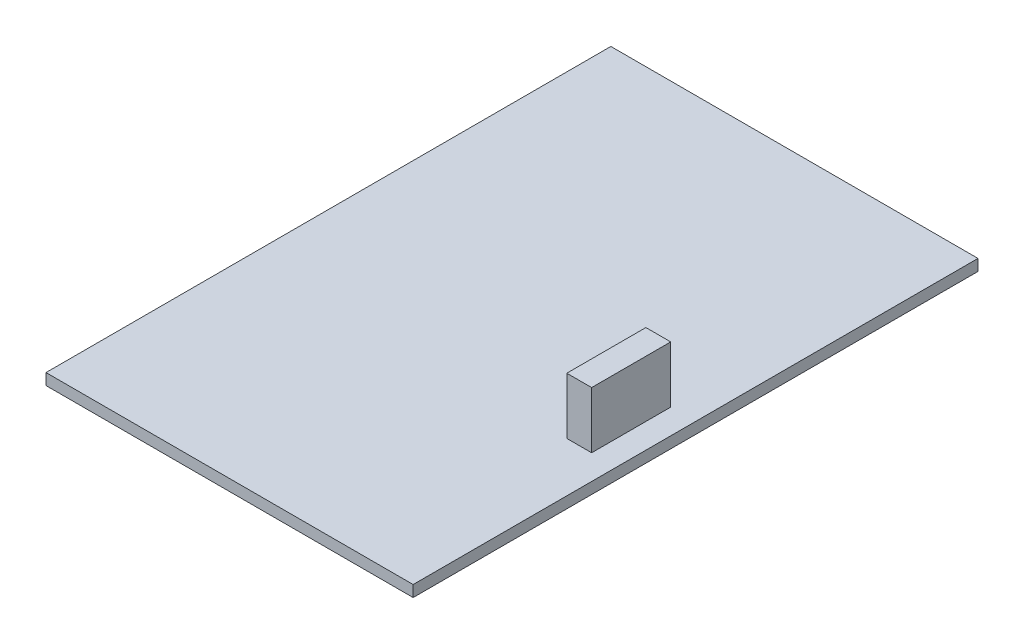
ISO-10303-21;
HEADER;
FILE_DESCRIPTION(('STEP AP214'),'2;1');
FILE_NAME('part.step','',(''),(''),'','','');
FILE_SCHEMA(('AUTOMOTIVE_DESIGN { 1 0 10303 214 1 1 1 1 }'));
ENDSEC;
DATA;
#1=APPLICATION_CONTEXT('core data for automotive mechanical design processes');
#2=APPLICATION_PROTOCOL_DEFINITION('international standard','automotive_design',2000,#1);
#3=PRODUCT_CONTEXT('',#1,'mechanical');
#4=PRODUCT('Part','Part','',(#3));
#5=PRODUCT_RELATED_PRODUCT_CATEGORY('part','',(#4));
#6=PRODUCT_DEFINITION_FORMATION('','',#4);
#7=PRODUCT_DEFINITION_CONTEXT('part definition',#1,'design');
#8=PRODUCT_DEFINITION('design','',#6,#7);
#9=PRODUCT_DEFINITION_SHAPE('','',#8);
#10=(LENGTH_UNIT() NAMED_UNIT(*) SI_UNIT(.MILLI.,.METRE.));
#11=(NAMED_UNIT(*) PLANE_ANGLE_UNIT() SI_UNIT($,.RADIAN.));
#12=(NAMED_UNIT(*) SI_UNIT($,.STERADIAN.) SOLID_ANGLE_UNIT());
#13=UNCERTAINTY_MEASURE_WITH_UNIT(LENGTH_MEASURE(1.E-05),#10,'distance_accuracy_value','');
#14=(GEOMETRIC_REPRESENTATION_CONTEXT(3) GLOBAL_UNCERTAINTY_ASSIGNED_CONTEXT((#13)) GLOBAL_UNIT_ASSIGNED_CONTEXT((#10,
#11,#12)) REPRESENTATION_CONTEXT('',''));
#15=CARTESIAN_POINT('',(0.,0.,0.));
#16=DIRECTION('',(0.,0.,1.));
#17=DIRECTION('',(1.,0.,0.));
#18=AXIS2_PLACEMENT_3D('',#15,#16,#17);
#19=CARTESIAN_POINT('',(0.,10.,0.));
#20=DIRECTION('',(0.,-1.,0.));
#21=DIRECTION('',(0.,0.,-1.));
#22=AXIS2_PLACEMENT_3D('',#19,#20,#21);
#23=PLANE('',#22);
#24=DIRECTION('',(0.,0.,1.));
#25=VECTOR('',#24,1.);
#26=CARTESIAN_POINT('',(0.,10.,0.));
#27=LINE('',#26,#25);
#28=CARTESIAN_POINT('',(0.,10.,-500.));
#29=VERTEX_POINT('',#28);
#30=CARTESIAN_POINT('',(0.,10.,0.));
#31=VERTEX_POINT('',#30);
#32=EDGE_CURVE('E130',#29,#31,#27,.T.);
#33=ORIENTED_EDGE('',*,*,#32,.T.);
#34=DIRECTION('',(1.,0.,0.));
#35=VECTOR('',#34,1.);
#36=CARTESIAN_POINT('',(0.,10.,0.));
#37=LINE('',#36,#35);
#38=CARTESIAN_POINT('',(325.,10.,0.));
#39=VERTEX_POINT('',#38);
#40=EDGE_CURVE('E133',#31,#39,#37,.T.);
#41=ORIENTED_EDGE('',*,*,#40,.T.);
#42=DIRECTION('',(0.,0.,-1.));
#43=VECTOR('',#42,1.);
#44=CARTESIAN_POINT('',(325.,10.,0.));
#45=LINE('',#44,#43);
#46=CARTESIAN_POINT('',(325.,10.,-500.));
#47=VERTEX_POINT('',#46);
#48=EDGE_CURVE('E136',#39,#47,#45,.T.);
#49=ORIENTED_EDGE('',*,*,#48,.T.);
#50=DIRECTION('',(-1.,0.,0.));
#51=VECTOR('',#50,1.);
#52=CARTESIAN_POINT('',(0.,10.,-500.));
#53=LINE('',#52,#51);
#54=EDGE_CURVE('E138',#47,#29,#53,.T.);
#55=ORIENTED_EDGE('',*,*,#54,.T.);
#56=EDGE_LOOP('',(#33,#41,#49,#55));
#57=FACE_BOUND('',#56,.T.);
#58=DIRECTION('',(0.,0.,-1.));
#59=VECTOR('',#58,1.);
#60=CARTESIAN_POINT('',(303.,10.,-250.));
#61=LINE('',#60,#59);
#62=CARTESIAN_POINT('',(303.,10.,-180.));
#63=VERTEX_POINT('',#62);
#64=CARTESIAN_POINT('',(303.,10.,-250.));
#65=VERTEX_POINT('',#64);
#66=EDGE_CURVE('E120',#63,#65,#61,.T.);
#67=ORIENTED_EDGE('',*,*,#66,.F.);
#68=DIRECTION('',(1.,0.,0.));
#69=VECTOR('',#68,1.);
#70=CARTESIAN_POINT('',(303.,10.,-180.));
#71=LINE('',#70,#69);
#72=CARTESIAN_POINT('',(281.,10.,-180.));
#73=VERTEX_POINT('',#72);
#74=EDGE_CURVE('E117',#73,#63,#71,.T.);
#75=ORIENTED_EDGE('',*,*,#74,.F.);
#76=DIRECTION('',(0.,0.,1.));
#77=VECTOR('',#76,1.);
#78=CARTESIAN_POINT('',(281.,10.,-250.));
#79=LINE('',#78,#77);
#80=CARTESIAN_POINT('',(281.,10.,-250.));
#81=VERTEX_POINT('',#80);
#82=EDGE_CURVE('E55',#81,#73,#79,.T.);
#83=ORIENTED_EDGE('',*,*,#82,.F.);
#84=DIRECTION('',(-1.,0.,0.));
#85=VECTOR('',#84,1.);
#86=CARTESIAN_POINT('',(303.,10.,-250.));
#87=LINE('',#86,#85);
#88=EDGE_CURVE('E50',#65,#81,#87,.T.);
#89=ORIENTED_EDGE('',*,*,#88,.F.);
#90=EDGE_LOOP('',(#67,#75,#83,#89));
#91=FACE_BOUND('',#90,.T.);
#92=ADVANCED_FACE('F35',(#57,#91),#23,.F.);
#93=CARTESIAN_POINT('',(0.,10.,0.));
#94=DIRECTION('',(1.,0.,0.));
#95=DIRECTION('',(0.,0.,-1.));
#96=AXIS2_PLACEMENT_3D('',#93,#94,#95);
#97=PLANE('',#96);
#98=DIRECTION('',(0.,0.,1.));
#99=VECTOR('',#98,1.);
#100=CARTESIAN_POINT('',(0.,0.,0.));
#101=LINE('',#100,#99);
#102=CARTESIAN_POINT('',(0.,0.,-500.));
#103=VERTEX_POINT('',#102);
#104=CARTESIAN_POINT('',(0.,0.,0.));
#105=VERTEX_POINT('',#104);
#106=EDGE_CURVE('E121',#103,#105,#101,.T.);
#107=ORIENTED_EDGE('',*,*,#106,.T.);
#108=DIRECTION('',(0.,-1.,0.));
#109=VECTOR('',#108,1.);
#110=CARTESIAN_POINT('',(0.,10.,0.));
#111=LINE('',#110,#109);
#112=EDGE_CURVE('E11',#31,#105,#111,.T.);
#113=ORIENTED_EDGE('',*,*,#112,.F.);
#114=ORIENTED_EDGE('',*,*,#32,.F.);
#115=DIRECTION('',(0.,-1.,0.));
#116=VECTOR('',#115,1.);
#117=CARTESIAN_POINT('',(0.,10.,-500.));
#118=LINE('',#117,#116);
#119=EDGE_CURVE('E139',#29,#103,#118,.T.);
#120=ORIENTED_EDGE('',*,*,#119,.T.);
#121=EDGE_LOOP('',(#107,#113,#114,#120));
#122=FACE_BOUND('',#121,.T.);
#123=ADVANCED_FACE('F37',(#122),#97,.F.);
#124=CARTESIAN_POINT('',(0.,10.,0.));
#125=DIRECTION('',(0.,0.,-1.));
#126=DIRECTION('',(-1.,0.,0.));
#127=AXIS2_PLACEMENT_3D('',#124,#125,#126);
#128=PLANE('',#127);
#129=DIRECTION('',(1.,0.,0.));
#130=VECTOR('',#129,1.);
#131=CARTESIAN_POINT('',(0.,0.,0.));
#132=LINE('',#131,#130);
#133=CARTESIAN_POINT('',(325.,0.,0.));
#134=VERTEX_POINT('',#133);
#135=EDGE_CURVE('E124',#105,#134,#132,.T.);
#136=ORIENTED_EDGE('',*,*,#135,.T.);
#137=DIRECTION('',(0.,-1.,0.));
#138=VECTOR('',#137,1.);
#139=CARTESIAN_POINT('',(325.,10.,0.));
#140=LINE('',#139,#138);
#141=EDGE_CURVE('E43',#39,#134,#140,.T.);
#142=ORIENTED_EDGE('',*,*,#141,.F.);
#143=ORIENTED_EDGE('',*,*,#40,.F.);
#144=ORIENTED_EDGE('',*,*,#112,.T.);
#145=EDGE_LOOP('',(#136,#142,#143,#144));
#146=FACE_BOUND('',#145,.T.);
#147=ADVANCED_FACE('F169',(#146),#128,.F.);
#148=CARTESIAN_POINT('',(325.,10.,0.));
#149=DIRECTION('',(-1.,0.,0.));
#150=DIRECTION('',(0.,0.,1.));
#151=AXIS2_PLACEMENT_3D('',#148,#149,#150);
#152=PLANE('',#151);
#153=DIRECTION('',(0.,0.,-1.));
#154=VECTOR('',#153,1.);
#155=CARTESIAN_POINT('',(325.,0.,0.));
#156=LINE('',#155,#154);
#157=CARTESIAN_POINT('',(325.,0.,-500.));
#158=VERTEX_POINT('',#157);
#159=EDGE_CURVE('E142',#134,#158,#156,.T.);
#160=ORIENTED_EDGE('',*,*,#159,.T.);
#161=DIRECTION('',(0.,-1.,0.));
#162=VECTOR('',#161,1.);
#163=CARTESIAN_POINT('',(325.,10.,-500.));
#164=LINE('',#163,#162);
#165=EDGE_CURVE('E147',#47,#158,#164,.T.);
#166=ORIENTED_EDGE('',*,*,#165,.F.);
#167=ORIENTED_EDGE('',*,*,#48,.F.);
#168=ORIENTED_EDGE('',*,*,#141,.T.);
#169=EDGE_LOOP('',(#160,#166,#167,#168));
#170=FACE_BOUND('',#169,.T.);
#171=ADVANCED_FACE('F154',(#170),#152,.F.);
#172=CARTESIAN_POINT('',(0.,10.,-500.));
#173=DIRECTION('',(0.,0.,1.));
#174=DIRECTION('',(1.,0.,0.));
#175=AXIS2_PLACEMENT_3D('',#172,#173,#174);
#176=PLANE('',#175);
#177=DIRECTION('',(-1.,0.,0.));
#178=VECTOR('',#177,1.);
#179=CARTESIAN_POINT('',(0.,0.,-500.));
#180=LINE('',#179,#178);
#181=EDGE_CURVE('E134',#158,#103,#180,.T.);
#182=ORIENTED_EDGE('',*,*,#181,.T.);
#183=ORIENTED_EDGE('',*,*,#119,.F.);
#184=ORIENTED_EDGE('',*,*,#54,.F.);
#185=ORIENTED_EDGE('',*,*,#165,.T.);
#186=EDGE_LOOP('',(#182,#183,#184,#185));
#187=FACE_BOUND('',#186,.T.);
#188=ADVANCED_FACE('F163',(#187),#176,.F.);
#189=CARTESIAN_POINT('',(0.,0.,0.));
#190=DIRECTION('',(0.,-1.,0.));
#191=DIRECTION('',(0.,0.,-1.));
#192=AXIS2_PLACEMENT_3D('',#189,#190,#191);
#193=PLANE('',#192);
#194=ORIENTED_EDGE('',*,*,#106,.F.);
#195=ORIENTED_EDGE('',*,*,#181,.F.);
#196=ORIENTED_EDGE('',*,*,#159,.F.);
#197=ORIENTED_EDGE('',*,*,#135,.F.);
#198=EDGE_LOOP('',(#194,#195,#196,#197));
#199=FACE_BOUND('',#198,.T.);
#200=ADVANCED_FACE('F160',(#199),#193,.T.);
#201=CARTESIAN_POINT('',(303.,60.,-250.));
#202=DIRECTION('',(-1.,0.,0.));
#203=DIRECTION('',(0.,0.,1.));
#204=AXIS2_PLACEMENT_3D('',#201,#202,#203);
#205=PLANE('',#204);
#206=ORIENTED_EDGE('',*,*,#66,.T.);
#207=DIRECTION('',(0.,-1.,0.));
#208=VECTOR('',#207,1.);
#209=CARTESIAN_POINT('',(303.,60.,-250.));
#210=LINE('',#209,#208);
#211=CARTESIAN_POINT('',(303.,60.,-250.));
#212=VERTEX_POINT('',#211);
#213=EDGE_CURVE('E101',#212,#65,#210,.T.);
#214=ORIENTED_EDGE('',*,*,#213,.F.);
#215=DIRECTION('',(0.,0.,-1.));
#216=VECTOR('',#215,1.);
#217=CARTESIAN_POINT('',(303.,60.,-250.));
#218=LINE('',#217,#216);
#219=CARTESIAN_POINT('',(303.,60.,-180.));
#220=VERTEX_POINT('',#219);
#221=EDGE_CURVE('E108',#220,#212,#218,.T.);
#222=ORIENTED_EDGE('',*,*,#221,.F.);
#223=DIRECTION('',(0.,-1.,0.));
#224=VECTOR('',#223,1.);
#225=CARTESIAN_POINT('',(303.,60.,-180.));
#226=LINE('',#225,#224);
#227=EDGE_CURVE('E262',#220,#63,#226,.T.);
#228=ORIENTED_EDGE('',*,*,#227,.T.);
#229=EDGE_LOOP('',(#206,#214,#222,#228));
#230=FACE_BOUND('',#229,.T.);
#231=ADVANCED_FACE('F119',(#230),#205,.F.);
#232=CARTESIAN_POINT('',(303.,60.,-250.));
#233=DIRECTION('',(0.,0.,1.));
#234=DIRECTION('',(1.,0.,0.));
#235=AXIS2_PLACEMENT_3D('',#232,#233,#234);
#236=PLANE('',#235);
#237=ORIENTED_EDGE('',*,*,#88,.T.);
#238=DIRECTION('',(0.,-1.,0.));
#239=VECTOR('',#238,1.);
#240=CARTESIAN_POINT('',(281.,60.,-250.));
#241=LINE('',#240,#239);
#242=CARTESIAN_POINT('',(281.,60.,-250.));
#243=VERTEX_POINT('',#242);
#244=EDGE_CURVE('E104',#243,#81,#241,.T.);
#245=ORIENTED_EDGE('',*,*,#244,.F.);
#246=DIRECTION('',(-1.,0.,0.));
#247=VECTOR('',#246,1.);
#248=CARTESIAN_POINT('',(303.,60.,-250.));
#249=LINE('',#248,#247);
#250=EDGE_CURVE('E97',#212,#243,#249,.T.);
#251=ORIENTED_EDGE('',*,*,#250,.F.);
#252=ORIENTED_EDGE('',*,*,#213,.T.);
#253=EDGE_LOOP('',(#237,#245,#251,#252));
#254=FACE_BOUND('',#253,.T.);
#255=ADVANCED_FACE('F99',(#254),#236,.F.);
#256=CARTESIAN_POINT('',(281.,60.,-250.));
#257=DIRECTION('',(1.,0.,0.));
#258=DIRECTION('',(0.,0.,-1.));
#259=AXIS2_PLACEMENT_3D('',#256,#257,#258);
#260=PLANE('',#259);
#261=ORIENTED_EDGE('',*,*,#82,.T.);
#262=DIRECTION('',(0.,-1.,0.));
#263=VECTOR('',#262,1.);
#264=CARTESIAN_POINT('',(281.,60.,-180.));
#265=LINE('',#264,#263);
#266=CARTESIAN_POINT('',(281.,60.,-180.));
#267=VERTEX_POINT('',#266);
#268=EDGE_CURVE('E126',#267,#73,#265,.T.);
#269=ORIENTED_EDGE('',*,*,#268,.F.);
#270=DIRECTION('',(0.,0.,1.));
#271=VECTOR('',#270,1.);
#272=CARTESIAN_POINT('',(281.,60.,-250.));
#273=LINE('',#272,#271);
#274=EDGE_CURVE('E107',#243,#267,#273,.T.);
#275=ORIENTED_EDGE('',*,*,#274,.F.);
#276=ORIENTED_EDGE('',*,*,#244,.T.);
#277=EDGE_LOOP('',(#261,#269,#275,#276));
#278=FACE_BOUND('',#277,.T.);
#279=ADVANCED_FACE('F205',(#278),#260,.F.);
#280=CARTESIAN_POINT('',(303.,60.,-180.));
#281=DIRECTION('',(0.,0.,-1.));
#282=DIRECTION('',(-1.,0.,0.));
#283=AXIS2_PLACEMENT_3D('',#280,#281,#282);
#284=PLANE('',#283);
#285=ORIENTED_EDGE('',*,*,#74,.T.);
#286=ORIENTED_EDGE('',*,*,#227,.F.);
#287=DIRECTION('',(1.,0.,0.));
#288=VECTOR('',#287,1.);
#289=CARTESIAN_POINT('',(303.,60.,-180.));
#290=LINE('',#289,#288);
#291=EDGE_CURVE('E113',#267,#220,#290,.T.);
#292=ORIENTED_EDGE('',*,*,#291,.F.);
#293=ORIENTED_EDGE('',*,*,#268,.T.);
#294=EDGE_LOOP('',(#285,#286,#292,#293));
#295=FACE_BOUND('',#294,.T.);
#296=ADVANCED_FACE('F211',(#295),#284,.F.);
#297=CARTESIAN_POINT('',(0.,60.,0.));
#298=DIRECTION('',(0.,-1.,0.));
#299=DIRECTION('',(0.,0.,-1.));
#300=AXIS2_PLACEMENT_3D('',#297,#298,#299);
#301=PLANE('',#300);
#302=ORIENTED_EDGE('',*,*,#221,.T.);
#303=ORIENTED_EDGE('',*,*,#250,.T.);
#304=ORIENTED_EDGE('',*,*,#274,.T.);
#305=ORIENTED_EDGE('',*,*,#291,.T.);
#306=EDGE_LOOP('',(#302,#303,#304,#305));
#307=FACE_BOUND('',#306,.T.);
#308=ADVANCED_FACE('F111',(#307),#301,.F.);
#309=CLOSED_SHELL('',(#92,#123,#147,#171,#188,#200,#231,#255,#279,#296,#308));
#310=MANIFOLD_SOLID_BREP('B2',#309);
#311=ADVANCED_BREP_SHAPE_REPRESENTATION('',(#18,#310),#14);
#312=SHAPE_DEFINITION_REPRESENTATION(#9,#311);
ENDSEC;
END-ISO-10303-21;
